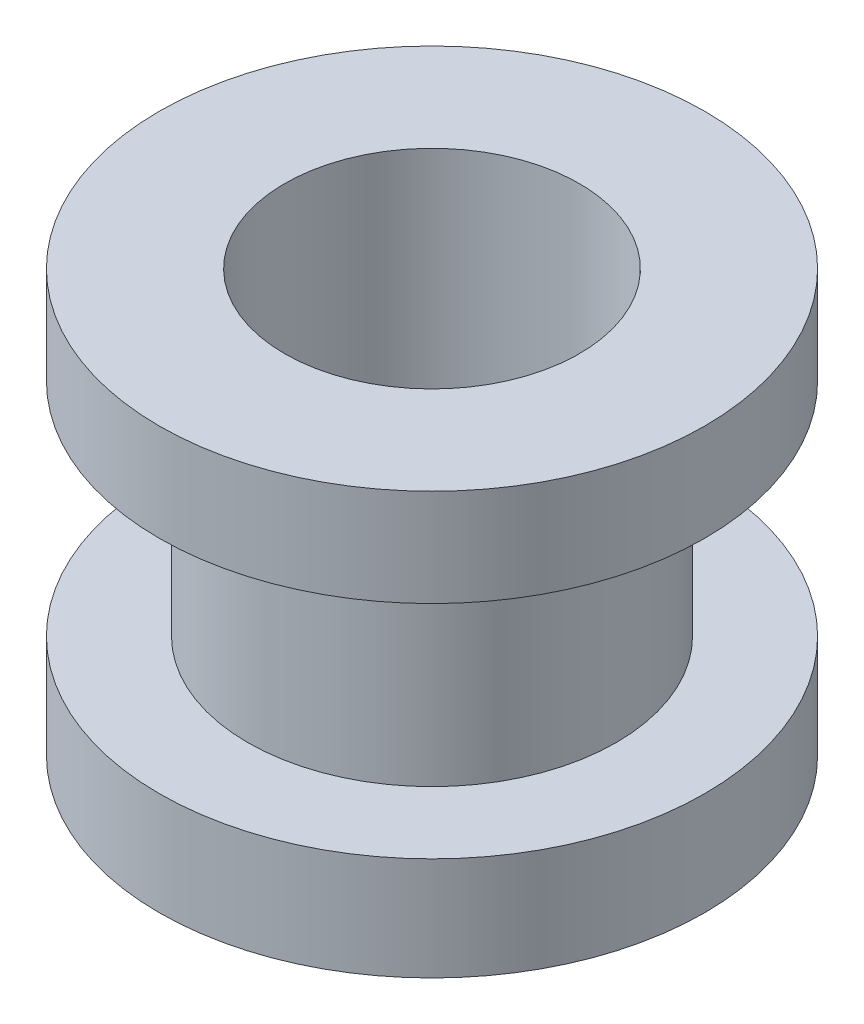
from build123d import *

# Parameters (mm, degrees)
SKETCH1_R               = 4.699
EXTRUDE1_DEPTH          = 1.6764
SKETCH2_R               = 3.175
EXTRUDE2_DEPTH          = 3.81
EXTRUDE3_START          = 1.778
SKETCH3_R               = 4.699
EXTRUDE3_DEPTH          = 1.778
CUT_EXTRUDE1_DEPTH      = 9.682565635
CUT_EXTRUDE1_DEPTH_BACK = 9.682565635
SKETCH4_R               = 2.54


with BuildPart() as part:
    # Sketch1 → Extrude1 (new body)
    with BuildSketch(Plane(origin=(0, 0, 0), x_dir=(1, 0, 0), z_dir=(0, 1, 0))):
        with Locations(Location((0, 0, 0), (0, 0, 270))):
            Circle(SKETCH1_R)
    extrude(amount=EXTRUDE1_DEPTH)

    # Sketch2 → Extrude2 (add)
    with BuildSketch(Plane(origin=(0, 0, 0), x_dir=(1, 0, 0), z_dir=(0, 1, 0))):
        with Locations(Location((0, 0, 0), (0, 0, 270))):
            Circle(SKETCH2_R)
    extrude(amount=-EXTRUDE2_DEPTH)

    # Sketch3 → Extrude3 (add)
    with BuildSketch(Plane.XZ.offset(3.81).offset(EXTRUDE3_START)):
        with Locations(Location((0, 0, 0), (0, 0, 90))):
            Circle(SKETCH3_R)
    extrude(amount=-EXTRUDE3_DEPTH)

    # Sketch4 → Cut-Extrude1 (cut, two sides: drawn at the far end of the back side and taken through both)
    with BuildSketch(Plane(origin=(0, 0, 0), x_dir=(1, 0, 0), z_dir=(0, 1, 0)).offset(-CUT_EXTRUDE1_DEPTH_BACK)):
        with Locations(Location((0, 0, 0), (0, 0, 270))):
            Circle(SKETCH4_R)
    extrude(amount=CUT_EXTRUDE1_DEPTH + CUT_EXTRUDE1_DEPTH_BACK, mode=Mode.SUBTRACT)


solid = part.part
